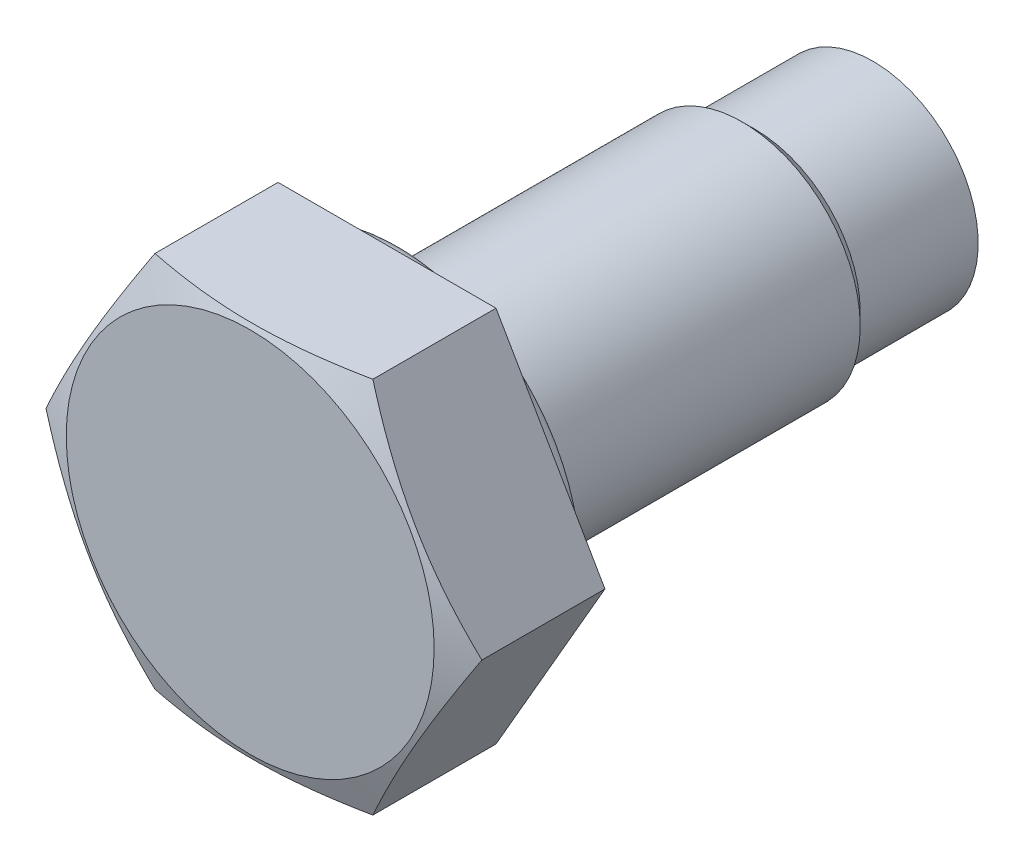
ISO-10303-21;
HEADER;
FILE_DESCRIPTION(('STEP AP214'),'2;1');
FILE_NAME('part.step','',(''),(''),'','','');
FILE_SCHEMA(('AUTOMOTIVE_DESIGN { 1 0 10303 214 1 1 1 1 }'));
ENDSEC;
DATA;
#1=APPLICATION_CONTEXT('core data for automotive mechanical design processes');
#2=APPLICATION_PROTOCOL_DEFINITION('international standard','automotive_design',2000,#1);
#3=PRODUCT_CONTEXT('',#1,'mechanical');
#4=PRODUCT('Part','Part','',(#3));
#5=PRODUCT_RELATED_PRODUCT_CATEGORY('part','',(#4));
#6=PRODUCT_DEFINITION_FORMATION('','',#4);
#7=PRODUCT_DEFINITION_CONTEXT('part definition',#1,'design');
#8=PRODUCT_DEFINITION('design','',#6,#7);
#9=PRODUCT_DEFINITION_SHAPE('','',#8);
#10=(LENGTH_UNIT() NAMED_UNIT(*) SI_UNIT(.MILLI.,.METRE.));
#11=(NAMED_UNIT(*) PLANE_ANGLE_UNIT() SI_UNIT($,.RADIAN.));
#12=(NAMED_UNIT(*) SI_UNIT($,.STERADIAN.) SOLID_ANGLE_UNIT());
#13=UNCERTAINTY_MEASURE_WITH_UNIT(LENGTH_MEASURE(1.E-05),#10,'distance_accuracy_value','');
#14=(GEOMETRIC_REPRESENTATION_CONTEXT(3) GLOBAL_UNCERTAINTY_ASSIGNED_CONTEXT((#13)) GLOBAL_UNIT_ASSIGNED_CONTEXT((#10,
#11,#12)) REPRESENTATION_CONTEXT('',''));
#15=CARTESIAN_POINT('',(0.,0.,0.));
#16=DIRECTION('',(0.,0.,1.));
#17=DIRECTION('',(1.,0.,0.));
#18=AXIS2_PLACEMENT_3D('',#15,#16,#17);
#19=CARTESIAN_POINT('',(0.,7.915,0.6));
#20=DIRECTION('',(0.,0.,1.));
#21=DIRECTION('',(1.,0.,0.));
#22=AXIS2_PLACEMENT_3D('',#19,#20,#21);
#23=PLANE('',#22);
#24=CARTESIAN_POINT('',(0.,0.,0.6));
#25=DIRECTION('',(0.,0.,1.));
#26=DIRECTION('',(1.,0.,0.));
#27=AXIS2_PLACEMENT_3D('',#24,#25,#26);
#28=CIRCLE('',#27,7.915);
#29=CARTESIAN_POINT('',(7.915,0.,0.6));
#30=VERTEX_POINT('',#29);
#31=EDGE_CURVE('E242',#30,#30,#28,.T.);
#32=ORIENTED_EDGE('',*,*,#31,.T.);
#33=EDGE_LOOP('',(#32));
#34=FACE_BOUND('',#33,.T.);
#35=DIRECTION('',(-1.,0.,0.));
#36=VECTOR('',#35,1.);
#37=CARTESIAN_POINT('',(0.,-7.99999626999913,0.6));
#38=LINE('',#37,#36);
#39=CARTESIAN_POINT('',(4.6188,-7.99999626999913,0.6));
#40=VERTEX_POINT('',#39);
#41=CARTESIAN_POINT('',(-4.6188,-7.99999626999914,0.6));
#42=VERTEX_POINT('',#41);
#43=EDGE_CURVE('E228',#40,#42,#38,.T.);
#44=ORIENTED_EDGE('',*,*,#43,.T.);
#45=DIRECTION('',(-0.5,0.866025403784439,0.));
#46=VECTOR('',#45,1.);
#47=CARTESIAN_POINT('',(-10.3554955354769,1.93625186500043,0.6));
#48=LINE('',#47,#46);
#49=CARTESIAN_POINT('',(-9.2376,0.,0.6));
#50=VERTEX_POINT('',#49);
#51=EDGE_CURVE('E98',#42,#50,#48,.T.);
#52=ORIENTED_EDGE('',*,*,#51,.T.);
#53=DIRECTION('',(0.5,0.866025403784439,0.));
#54=VECTOR('',#53,1.);
#55=CARTESIAN_POINT('',(-3.50090446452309,9.93624813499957,0.6));
#56=LINE('',#55,#54);
#57=CARTESIAN_POINT('',(-4.6188,7.99999626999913,0.6));
#58=VERTEX_POINT('',#57);
#59=EDGE_CURVE('E236',#50,#58,#56,.T.);
#60=ORIENTED_EDGE('',*,*,#59,.T.);
#61=DIRECTION('',(1.,0.,0.));
#62=VECTOR('',#61,1.);
#63=CARTESIAN_POINT('',(0.,7.99999626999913,0.6));
#64=LINE('',#63,#62);
#65=CARTESIAN_POINT('',(4.6188,7.99999626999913,0.6));
#66=VERTEX_POINT('',#65);
#67=EDGE_CURVE('E233',#58,#66,#64,.T.);
#68=ORIENTED_EDGE('',*,*,#67,.T.);
#69=DIRECTION('',(0.5,-0.866025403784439,0.));
#70=VECTOR('',#69,1.);
#71=CARTESIAN_POINT('',(3.50090446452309,9.93624813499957,0.6));
#72=LINE('',#71,#70);
#73=CARTESIAN_POINT('',(9.2376,0.,0.6));
#74=VERTEX_POINT('',#73);
#75=EDGE_CURVE('E231',#66,#74,#72,.T.);
#76=ORIENTED_EDGE('',*,*,#75,.T.);
#77=DIRECTION('',(-0.5,-0.866025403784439,0.));
#78=VECTOR('',#77,1.);
#79=CARTESIAN_POINT('',(10.3554955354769,1.93625186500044,0.6));
#80=LINE('',#79,#78);
#81=EDGE_CURVE('E216',#74,#40,#80,.T.);
#82=ORIENTED_EDGE('',*,*,#81,.T.);
#83=EDGE_LOOP('',(#44,#52,#60,#68,#76,#82));
#84=FACE_BOUND('',#83,.T.);
#85=ADVANCED_FACE('F31',(#34,#84),#23,.F.);
#86=CARTESIAN_POINT('',(0.,0.,-15.));
#87=DIRECTION('',(0.,0.,1.));
#88=DIRECTION('',(1.,0.,0.));
#89=AXIS2_PLACEMENT_3D('',#86,#87,#88);
#90=CONICAL_SURFACE('',#89,4.45875,0.78539816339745);
#91=CARTESIAN_POINT('',(0.,0.,-14.45875));
#92=DIRECTION('',(0.,0.,1.));
#93=DIRECTION('',(1.,0.,0.));
#94=AXIS2_PLACEMENT_3D('',#91,#92,#93);
#95=CIRCLE('',#94,5.);
#96=CARTESIAN_POINT('',(5.,0.,-14.45875));
#97=VERTEX_POINT('',#96);
#98=EDGE_CURVE('E91',#97,#97,#95,.T.);
#99=ORIENTED_EDGE('',*,*,#98,.F.);
#100=EDGE_LOOP('',(#99));
#101=FACE_BOUND('',#100,.T.);
#102=CARTESIAN_POINT('',(0.,0.,-15.));
#103=DIRECTION('',(0.,0.,-1.));
#104=DIRECTION('',(-1.,0.,0.));
#105=AXIS2_PLACEMENT_3D('',#102,#103,#104);
#106=CIRCLE('',#105,4.45875);
#107=CARTESIAN_POINT('',(-4.45875,0.,-15.));
#108=VERTEX_POINT('',#107);
#109=EDGE_CURVE('E321',#108,#108,#106,.T.);
#110=ORIENTED_EDGE('',*,*,#109,.F.);
#111=EDGE_LOOP('',(#110));
#112=FACE_BOUND('',#111,.T.);
#113=ADVANCED_FACE('F33',(#101,#112),#90,.T.);
#114=CARTESIAN_POINT('',(0.,0.,6.4));
#115=DIRECTION('',(0.,0.,1.));
#116=DIRECTION('',(1.,0.,0.));
#117=AXIS2_PLACEMENT_3D('',#114,#115,#116);
#118=CYLINDRICAL_SURFACE('',#117,5.);
#119=CARTESIAN_POINT('',(0.,0.,-1.));
#120=DIRECTION('',(0.,0.,1.));
#121=DIRECTION('',(1.,0.,0.));
#122=AXIS2_PLACEMENT_3D('',#119,#120,#121);
#123=CIRCLE('',#122,5.);
#124=CARTESIAN_POINT('',(5.,0.,-1.));
#125=VERTEX_POINT('',#124);
#126=EDGE_CURVE('E184',#125,#125,#123,.T.);
#127=ORIENTED_EDGE('',*,*,#126,.F.);
#128=EDGE_LOOP('',(#127));
#129=FACE_BOUND('',#128,.T.);
#130=ORIENTED_EDGE('',*,*,#98,.T.);
#131=EDGE_LOOP('',(#130));
#132=FACE_BOUND('',#131,.T.);
#133=ADVANCED_FACE('F150',(#129,#132),#118,.T.);
#134=CARTESIAN_POINT('',(0.,5.,-1.));
#135=DIRECTION('',(0.,0.,-1.));
#136=DIRECTION('',(-1.,0.,0.));
#137=AXIS2_PLACEMENT_3D('',#134,#135,#136);
#138=PLANE('',#137);
#139=CARTESIAN_POINT('',(0.,0.,-1.));
#140=DIRECTION('',(0.,0.,1.));
#141=DIRECTION('',(1.,0.,0.));
#142=AXIS2_PLACEMENT_3D('',#139,#140,#141);
#143=CIRCLE('',#142,4.45875);
#144=CARTESIAN_POINT('',(4.45875,0.,-1.));
#145=VERTEX_POINT('',#144);
#146=EDGE_CURVE('E188',#145,#145,#143,.T.);
#147=ORIENTED_EDGE('',*,*,#146,.F.);
#148=EDGE_LOOP('',(#147));
#149=FACE_BOUND('',#148,.T.);
#150=ORIENTED_EDGE('',*,*,#126,.T.);
#151=EDGE_LOOP('',(#150));
#152=FACE_BOUND('',#151,.T.);
#153=ADVANCED_FACE('F173',(#149,#152),#138,.F.);
#154=CARTESIAN_POINT('',(0.,0.,-1.));
#155=DIRECTION('',(0.,0.,1.));
#156=DIRECTION('',(1.,0.,0.));
#157=AXIS2_PLACEMENT_3D('',#154,#155,#156);
#158=CONICAL_SURFACE('',#157,4.45875,1.0471975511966);
#159=CARTESIAN_POINT('',(0.,0.,-0.687509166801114));
#160=DIRECTION('',(0.,0.,1.));
#161=DIRECTION('',(1.,0.,0.));
#162=AXIS2_PLACEMENT_3D('',#159,#160,#161);
#163=CIRCLE('',#162,5.);
#164=CARTESIAN_POINT('',(5.,0.,-0.687509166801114));
#165=VERTEX_POINT('',#164);
#166=EDGE_CURVE('E253',#165,#165,#163,.T.);
#167=ORIENTED_EDGE('',*,*,#166,.F.);
#168=EDGE_LOOP('',(#167));
#169=FACE_BOUND('',#168,.T.);
#170=ORIENTED_EDGE('',*,*,#146,.T.);
#171=EDGE_LOOP('',(#170));
#172=FACE_BOUND('',#171,.T.);
#173=ADVANCED_FACE('F169',(#169,#172),#158,.T.);
#174=CARTESIAN_POINT('',(0.,0.,6.4));
#175=DIRECTION('',(0.,0.,1.));
#176=DIRECTION('',(1.,0.,0.));
#177=AXIS2_PLACEMENT_3D('',#174,#175,#176);
#178=CYLINDRICAL_SURFACE('',#177,5.);
#179=CARTESIAN_POINT('',(0.,0.,-0.5));
#180=DIRECTION('',(0.,0.,1.));
#181=DIRECTION('',(1.,0.,0.));
#182=AXIS2_PLACEMENT_3D('',#179,#180,#181);
#183=CIRCLE('',#182,5.);
#184=CARTESIAN_POINT('',(5.,0.,-0.5));
#185=VERTEX_POINT('',#184);
#186=EDGE_CURVE('E250',#185,#185,#183,.T.);
#187=ORIENTED_EDGE('',*,*,#186,.F.);
#188=EDGE_LOOP('',(#187));
#189=FACE_BOUND('',#188,.T.);
#190=ORIENTED_EDGE('',*,*,#166,.T.);
#191=EDGE_LOOP('',(#190));
#192=FACE_BOUND('',#191,.T.);
#193=ADVANCED_FACE('F165',(#189,#192),#178,.T.);
#194=CARTESIAN_POINT('',(0.,0.,-0.5));
#195=DIRECTION('',(0.,0.,1.));
#196=DIRECTION('',(1.,0.,0.));
#197=AXIS2_PLACEMENT_3D('',#194,#195,#196);
#198=TOROIDAL_SURFACE('',#197,5.5,0.5);
#199=ORIENTED_EDGE('',*,*,#186,.T.);
#200=EDGE_LOOP('',(#199));
#201=FACE_BOUND('',#200,.T.);
#202=CARTESIAN_POINT('',(0.,0.,0.));
#203=DIRECTION('',(0.,0.,1.));
#204=DIRECTION('',(1.,0.,0.));
#205=AXIS2_PLACEMENT_3D('',#202,#203,#204);
#206=CIRCLE('',#205,5.5);
#207=CARTESIAN_POINT('',(5.5,0.,0.));
#208=VERTEX_POINT('',#207);
#209=EDGE_CURVE('E247',#208,#208,#206,.T.);
#210=ORIENTED_EDGE('',*,*,#209,.F.);
#211=EDGE_LOOP('',(#210));
#212=FACE_BOUND('',#211,.T.);
#213=ADVANCED_FACE('F161',(#201,#212),#198,.F.);
#214=CARTESIAN_POINT('',(0.,5.5,0.));
#215=DIRECTION('',(0.,0.,1.));
#216=DIRECTION('',(1.,0.,0.));
#217=AXIS2_PLACEMENT_3D('',#214,#215,#216);
#218=PLANE('',#217);
#219=CARTESIAN_POINT('',(0.,0.,0.));
#220=DIRECTION('',(0.,0.,1.));
#221=DIRECTION('',(1.,0.,0.));
#222=AXIS2_PLACEMENT_3D('',#219,#220,#221);
#223=CIRCLE('',#222,7.315);
#224=CARTESIAN_POINT('',(7.315,0.,0.));
#225=VERTEX_POINT('',#224);
#226=EDGE_CURVE('E244',#225,#225,#223,.T.);
#227=ORIENTED_EDGE('',*,*,#226,.F.);
#228=EDGE_LOOP('',(#227));
#229=FACE_BOUND('',#228,.T.);
#230=ORIENTED_EDGE('',*,*,#209,.T.);
#231=EDGE_LOOP('',(#230));
#232=FACE_BOUND('',#231,.T.);
#233=ADVANCED_FACE('F157',(#229,#232),#218,.F.);
#234=CARTESIAN_POINT('',(0.,0.,0.6));
#235=DIRECTION('',(0.,0.,1.));
#236=DIRECTION('',(1.,0.,0.));
#237=AXIS2_PLACEMENT_3D('',#234,#235,#236);
#238=TOROIDAL_SURFACE('',#237,7.315,0.6);
#239=ORIENTED_EDGE('',*,*,#31,.F.);
#240=EDGE_LOOP('',(#239));
#241=FACE_BOUND('',#240,.T.);
#242=ORIENTED_EDGE('',*,*,#226,.T.);
#243=EDGE_LOOP('',(#242));
#244=FACE_BOUND('',#243,.T.);
#245=ADVANCED_FACE('F132',(#241,#244),#238,.T.);
#246=CARTESIAN_POINT('',(-4.6188,-7.99999626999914,-15.));
#247=DIRECTION('',(0.866025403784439,0.5,0.));
#248=DIRECTION('',(0.5,-0.866025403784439,0.));
#249=AXIS2_PLACEMENT_3D('',#246,#247,#248);
#250=PLANE('',#249);
#251=ORIENTED_EDGE('',*,*,#51,.F.);
#252=DIRECTION('',(0.,0.,1.));
#253=VECTOR('',#252,1.);
#254=CARTESIAN_POINT('',(-4.6188,-7.99999626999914,-15.));
#255=LINE('',#254,#253);
#256=CARTESIAN_POINT('',(-4.6188,-7.99999626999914,5.81818181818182));
#257=VERTEX_POINT('',#256);
#258=EDGE_CURVE('E51',#42,#257,#255,.T.);
#259=ORIENTED_EDGE('',*,*,#258,.T.);
#260=CARTESIAN_POINT('',(-9.23760011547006,2.00000000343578E-07,5.81818177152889));
#261=CARTESIAN_POINT('',(-9.07623171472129,-0.279498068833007,5.88338258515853));
#262=CARTESIAN_POINT('',(-8.91433070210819,-0.559918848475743,5.94367122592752));
#263=CARTESIAN_POINT('',(-8.58945812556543,-1.12261465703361,6.0525711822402));
#264=CARTESIAN_POINT('',(-8.42648599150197,-1.40489067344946,6.10117565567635));
#265=CARTESIAN_POINT('',(-8.09970314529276,-1.97089516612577,6.184761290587));
#266=CARTESIAN_POINT('',(-7.93589269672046,-2.25462318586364,6.21974649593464));
#267=CARTESIAN_POINT('',(-7.60766331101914,-2.82313315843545,6.27447232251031));
#268=CARTESIAN_POINT('',(-7.44324451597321,-3.10791486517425,6.2942163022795));
#269=CARTESIAN_POINT('',(-7.116909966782,-3.67314288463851,6.31723187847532));
#270=CARTESIAN_POINT('',(-6.95499911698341,-3.95358070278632,6.3207774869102));
#271=CARTESIAN_POINT('',(-6.63127309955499,-4.51429061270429,6.31195075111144));
#272=CARTESIAN_POINT('',(-6.46945794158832,-4.79456268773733,6.29957700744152));
#273=CARTESIAN_POINT('',(-6.14641204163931,-5.35409459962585,6.25957675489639));
#274=CARTESIAN_POINT('',(-5.98518099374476,-5.63335496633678,6.23195993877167));
#275=CARTESIAN_POINT('',(-5.66348869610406,-6.19054237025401,6.16281191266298));
#276=CARTESIAN_POINT('',(-5.5030273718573,-6.46846953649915,6.12128207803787));
#277=CARTESIAN_POINT('',(-5.28250881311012,-6.85041888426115,6.05563542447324));
#278=CARTESIAN_POINT('',(-5.22204978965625,-6.95513698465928,6.03674445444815));
#279=CARTESIAN_POINT('',(-5.10127443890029,-7.16432602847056,5.99731748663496));
#280=CARTESIAN_POINT('',(-5.04095809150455,-7.26879700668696,5.9767817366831));
#281=CARTESIAN_POINT('',(-4.92025661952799,-7.4778580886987,5.93408711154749));
#282=CARTESIAN_POINT('',(-4.85987196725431,-7.58244737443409,5.91192291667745));
#283=CARTESIAN_POINT('',(-4.73923496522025,-7.79139679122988,5.86612783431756));
#284=CARTESIAN_POINT('',(-4.67898263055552,-7.89575689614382,5.84249678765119));
#285=CARTESIAN_POINT('',(-4.61879988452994,-7.99999646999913,5.81818177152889));
#286=B_SPLINE_CURVE_WITH_KNOTS('',3,(#260,#261,#262,#263,#264,#265,#266,#267,#268,#269,#270,
#271,#272,#273,#274,#275,#276,#277,#278,#279,#280,#281,#282,#283,#284,#285),.UNSPECIFIED.,.F.,
.F.,(4,2,2,2,2,2,2,2,2,2,2,2,4),(0.,0.987840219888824,1.97625750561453,2.96438108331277,
3.95228685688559,4.92341776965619,5.89463405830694,6.86523348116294,7.83573698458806,
8.20288448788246,8.56997677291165,8.93832669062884,9.30671665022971),.UNSPECIFIED.);
#287=CARTESIAN_POINT('',(-9.2376,0.,5.81818181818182));
#288=VERTEX_POINT('',#287);
#289=EDGE_CURVE('E11',#288,#257,#286,.T.);
#290=ORIENTED_EDGE('',*,*,#289,.F.);
#291=DIRECTION('',(0.,0.,1.));
#292=VECTOR('',#291,1.);
#293=CARTESIAN_POINT('',(-9.2376,0.,-15.));
#294=LINE('',#293,#292);
#295=EDGE_CURVE('E226',#50,#288,#294,.T.);
#296=ORIENTED_EDGE('',*,*,#295,.F.);
#297=EDGE_LOOP('',(#251,#259,#290,#296));
#298=FACE_BOUND('',#297,.T.);
#299=ADVANCED_FACE('F94',(#298),#250,.F.);
#300=CARTESIAN_POINT('',(-9.2376,0.,-15.));
#301=DIRECTION('',(0.866025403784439,-0.5,0.));
#302=DIRECTION('',(-0.5,-0.866025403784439,0.));
#303=AXIS2_PLACEMENT_3D('',#300,#301,#302);
#304=PLANE('',#303);
#305=ORIENTED_EDGE('',*,*,#59,.F.);
#306=ORIENTED_EDGE('',*,*,#295,.T.);
#307=CARTESIAN_POINT('',(-4.61879988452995,7.99999646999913,5.81818177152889));
#308=CARTESIAN_POINT('',(-4.78016828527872,7.72049820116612,5.88338258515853));
#309=CARTESIAN_POINT('',(-4.94206929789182,7.44007742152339,5.94367122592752));
#310=CARTESIAN_POINT('',(-5.26694187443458,6.87738161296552,6.0525711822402));
#311=CARTESIAN_POINT('',(-5.42991400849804,6.59510559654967,6.10117565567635));
#312=CARTESIAN_POINT('',(-5.75669685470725,6.02910110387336,6.184761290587));
#313=CARTESIAN_POINT('',(-5.92050730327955,5.74537308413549,6.21974649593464));
#314=CARTESIAN_POINT('',(-6.24873668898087,5.17686311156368,6.27447232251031));
#315=CARTESIAN_POINT('',(-6.4131554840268,4.89208140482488,6.2942163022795));
#316=CARTESIAN_POINT('',(-6.73949003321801,4.32685338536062,6.31723187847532));
#317=CARTESIAN_POINT('',(-6.90140088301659,4.04641556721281,6.3207774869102));
#318=CARTESIAN_POINT('',(-7.22512690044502,3.48570565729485,6.31195075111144));
#319=CARTESIAN_POINT('',(-7.38694205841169,3.2054335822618,6.29957700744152));
#320=CARTESIAN_POINT('',(-7.7099879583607,2.64590167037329,6.25957675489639));
#321=CARTESIAN_POINT('',(-7.87121900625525,2.36664130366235,6.23195993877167));
#322=CARTESIAN_POINT('',(-8.19291130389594,1.80945389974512,6.16281191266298));
#323=CARTESIAN_POINT('',(-8.35337262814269,1.53152673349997,6.12128207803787));
#324=CARTESIAN_POINT('',(-8.57389118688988,1.14957738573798,6.05563542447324));
#325=CARTESIAN_POINT('',(-8.63435021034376,1.04485928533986,6.03674445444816));
#326=CARTESIAN_POINT('',(-8.75512556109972,0.835670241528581,5.99731748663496));
#327=CARTESIAN_POINT('',(-8.81544190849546,0.731199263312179,5.9767817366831));
#328=CARTESIAN_POINT('',(-8.93614338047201,0.522138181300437,5.93408711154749));
#329=CARTESIAN_POINT('',(-8.99652803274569,0.417548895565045,5.91192291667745));
#330=CARTESIAN_POINT('',(-9.11716503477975,0.20859947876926,5.86612783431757));
#331=CARTESIAN_POINT('',(-9.17741736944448,0.104239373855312,5.84249678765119));
#332=CARTESIAN_POINT('',(-9.23760011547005,-1.99999999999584E-07,5.81818177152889));
#333=B_SPLINE_CURVE_WITH_KNOTS('',3,(#307,#308,#309,#310,#311,#312,#313,#314,#315,#316,#317,
#318,#319,#320,#321,#322,#323,#324,#325,#326,#327,#328,#329,#330,#331,#332),.UNSPECIFIED.,.F.,
.F.,(4,2,2,2,2,2,2,2,2,2,2,2,4),(0.,0.987840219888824,1.97625750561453,2.96438108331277,
3.95228685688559,4.92341776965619,5.89463405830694,6.86523348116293,7.83573698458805,
8.20288448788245,8.56997677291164,8.93832669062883,9.3067166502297),.UNSPECIFIED.);
#334=CARTESIAN_POINT('',(-4.6188,7.99999626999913,5.81818181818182));
#335=VERTEX_POINT('',#334);
#336=EDGE_CURVE('E44',#335,#288,#333,.T.);
#337=ORIENTED_EDGE('',*,*,#336,.F.);
#338=DIRECTION('',(0.,0.,1.));
#339=VECTOR('',#338,1.);
#340=CARTESIAN_POINT('',(-4.6188,7.99999626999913,-15.));
#341=LINE('',#340,#339);
#342=EDGE_CURVE('E221',#58,#335,#341,.T.);
#343=ORIENTED_EDGE('',*,*,#342,.F.);
#344=EDGE_LOOP('',(#305,#306,#337,#343));
#345=FACE_BOUND('',#344,.T.);
#346=ADVANCED_FACE('F124',(#345),#304,.F.);
#347=CARTESIAN_POINT('',(-4.6188,7.99999626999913,-15.));
#348=DIRECTION('',(0.,-1.,0.));
#349=DIRECTION('',(-1.,0.,0.));
#350=AXIS2_PLACEMENT_3D('',#347,#348,#349);
#351=PLANE('',#350);
#352=ORIENTED_EDGE('',*,*,#67,.F.);
#353=ORIENTED_EDGE('',*,*,#342,.T.);
#354=CARTESIAN_POINT('',(-12.5719547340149,7.99999626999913,3.52982738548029));
#355=CARTESIAN_POINT('',(-12.1983187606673,7.99999626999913,3.65714990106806));
#356=CARTESIAN_POINT('',(-11.8241969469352,7.99999626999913,3.78307295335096));
#357=CARTESIAN_POINT('',(-11.0747197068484,7.99999626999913,4.03131289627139));
#358=CARTESIAN_POINT('',(-10.6993641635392,7.99999626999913,4.15362943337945));
#359=CARTESIAN_POINT('',(-9.94620503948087,7.99999626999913,4.39415137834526));
#360=CARTESIAN_POINT('',(-9.56839757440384,7.99999626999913,4.51234466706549));
#361=CARTESIAN_POINT('',(-8.81107863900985,7.99999626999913,4.74312776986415));
#362=CARTESIAN_POINT('',(-8.43156721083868,7.99999626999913,4.8557177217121));
#363=CARTESIAN_POINT('',(-7.67246142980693,7.99999626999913,5.07327543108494));
#364=CARTESIAN_POINT('',(-7.29287748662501,7.99999626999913,5.17827932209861));
#365=CARTESIAN_POINT('',(-6.53133965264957,7.99999626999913,5.37943691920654));
#366=CARTESIAN_POINT('',(-6.14938567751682,7.99999626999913,5.47559030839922));
#367=CARTESIAN_POINT('',(-5.38308686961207,7.99999626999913,5.65661961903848));
#368=CARTESIAN_POINT('',(-4.99874399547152,7.99999626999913,5.74150375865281));
#369=CARTESIAN_POINT('',(-4.22720948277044,7.99999626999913,5.89721151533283));
#370=CARTESIAN_POINT('',(-3.84001810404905,7.99999626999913,5.96803639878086));
#371=CARTESIAN_POINT('',(-3.15468340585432,7.99999626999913,6.07772100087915));
#372=CARTESIAN_POINT('',(-2.85711851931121,7.99999626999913,6.12017938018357));
#373=CARTESIAN_POINT('',(-2.26056309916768,7.99999626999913,6.19360511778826));
#374=CARTESIAN_POINT('',(-1.9615726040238,7.99999626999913,6.22457278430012));
#375=CARTESIAN_POINT('',(-1.36269467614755,7.99999626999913,6.27378877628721));
#376=CARTESIAN_POINT('',(-1.06280781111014,7.99999626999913,6.29204392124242));
#377=CARTESIAN_POINT('',(-0.462511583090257,7.99999626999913,6.31505964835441));
#378=CARTESIAN_POINT('',(-0.162102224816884,7.99999626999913,6.31982035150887));
#379=CARTESIAN_POINT('',(0.438718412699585,7.99999626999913,6.31562600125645));
#380=CARTESIAN_POINT('',(0.739129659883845,7.99999626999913,6.30666642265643));
#381=CARTESIAN_POINT('',(1.33925291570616,7.99999626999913,6.27543464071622));
#382=CARTESIAN_POINT('',(1.63896491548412,7.99999626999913,6.25316226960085));
#383=CARTESIAN_POINT('',(2.23737206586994,7.99999626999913,6.19623962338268));
#384=CARTESIAN_POINT('',(2.53606652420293,7.99999626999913,6.16158216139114));
#385=CARTESIAN_POINT('',(3.13194924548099,7.99999626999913,6.08119272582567));
#386=CARTESIAN_POINT('',(3.42913747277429,7.99999626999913,6.03546049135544));
#387=CARTESIAN_POINT('',(4.11363187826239,7.99999626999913,5.91871471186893));
#388=CARTESIAN_POINT('',(4.50034816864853,7.99999626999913,5.84425774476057));
#389=CARTESIAN_POINT('',(5.27095740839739,7.99999626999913,5.68198807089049));
#390=CARTESIAN_POINT('',(5.65485012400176,7.99999626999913,5.59417427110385));
#391=CARTESIAN_POINT('',(6.42025470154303,7.99999626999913,5.40788960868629));
#392=CARTESIAN_POINT('',(6.80176506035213,7.99999626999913,5.30941262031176));
#393=CARTESIAN_POINT('',(7.56249587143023,7.99999626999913,5.10408437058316));
#394=CARTESIAN_POINT('',(7.94171640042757,7.99999626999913,4.99723339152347));
#395=CARTESIAN_POINT('',(8.69926332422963,7.99999626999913,4.77660865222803));
#396=CARTESIAN_POINT('',(9.07758437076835,7.99999626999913,4.66281661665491));
#397=CARTESIAN_POINT('',(9.83259783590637,7.99999626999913,4.42994140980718));
#398=CARTESIAN_POINT('',(10.2092902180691,7.99999626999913,4.31085812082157));
#399=CARTESIAN_POINT('',(10.9604179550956,7.99999626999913,4.06875367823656));
#400=CARTESIAN_POINT('',(11.3348565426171,7.99999626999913,3.94574252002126));
#401=CARTESIAN_POINT('',(12.0825558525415,7.99999626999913,3.69629462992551));
#402=CARTESIAN_POINT('',(12.4558166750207,7.99999626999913,3.56985819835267));
#403=CARTESIAN_POINT('',(12.8286123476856,7.99999626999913,3.44208796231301));
#404=B_SPLINE_CURVE_WITH_KNOTS('',3,(#354,#355,#356,#357,#358,#359,#360,#361,#362,#363,#364,
#365,#366,#367,#368,#369,#370,#371,#372,#373,#374,#375,#376,#377,#378,#379,#380,#381,#382,#383,
#384,#385,#386,#387,#388,#389,#390,#391,#392,#393,#394,#395,#396,#397,#398,#399,#400,#401,#402,
#403),.UNSPECIFIED.,.F.,.F.,(4,2,2,2,2,2,2,2,2,2,2,2,2,2,2,2,2,2,2,2,2,2,2,2,4),(0.,
1.18421166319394,2.36853902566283,3.55609567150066,4.74362310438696,5.92505950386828,
7.10653818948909,8.28715048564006,9.46765639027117,10.3692009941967,11.2707214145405,
12.1717578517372,13.0727862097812,13.9741118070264,14.8754487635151,15.777309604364,
16.6791916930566,17.8603375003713,19.0415800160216,20.2235047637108,21.4053896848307,
22.5905333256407,23.7757033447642,24.9580661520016,26.1403256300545),.UNSPECIFIED.);
#405=CARTESIAN_POINT('',(4.6188,7.99999626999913,5.81818181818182));
#406=VERTEX_POINT('',#405);
#407=EDGE_CURVE('E106',#406,#335,#404,.F.);
#408=ORIENTED_EDGE('',*,*,#407,.F.);
#409=DIRECTION('',(0.,0.,1.));
#410=VECTOR('',#409,1.);
#411=CARTESIAN_POINT('',(4.6188,7.99999626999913,-15.));
#412=LINE('',#411,#410);
#413=EDGE_CURVE('E218',#66,#406,#412,.T.);
#414=ORIENTED_EDGE('',*,*,#413,.F.);
#415=EDGE_LOOP('',(#352,#353,#408,#414));
#416=FACE_BOUND('',#415,.T.);
#417=ADVANCED_FACE('F127',(#416),#351,.F.);
#418=CARTESIAN_POINT('',(4.6188,7.99999626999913,-15.));
#419=DIRECTION('',(-0.866025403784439,-0.5,0.));
#420=DIRECTION('',(-0.5,0.866025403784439,0.));
#421=AXIS2_PLACEMENT_3D('',#418,#419,#420);
#422=PLANE('',#421);
#423=ORIENTED_EDGE('',*,*,#75,.F.);
#424=ORIENTED_EDGE('',*,*,#413,.T.);
#425=CARTESIAN_POINT('',(9.23760011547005,-1.9999999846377E-07,5.81818177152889));
#426=CARTESIAN_POINT('',(9.07623171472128,0.279498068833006,5.88338258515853));
#427=CARTESIAN_POINT('',(8.91433070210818,0.559918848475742,5.94367122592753));
#428=CARTESIAN_POINT('',(8.58945812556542,1.12261465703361,6.0525711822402));
#429=CARTESIAN_POINT('',(8.42648599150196,1.40489067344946,6.10117565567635));
#430=CARTESIAN_POINT('',(8.09970314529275,1.97089516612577,6.18476129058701));
#431=CARTESIAN_POINT('',(7.93589269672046,2.25462318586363,6.21974649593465));
#432=CARTESIAN_POINT('',(7.60766331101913,2.82313315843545,6.27447232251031));
#433=CARTESIAN_POINT('',(7.44324451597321,3.10791486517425,6.29421630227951));
#434=CARTESIAN_POINT('',(7.11690996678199,3.67314288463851,6.31723187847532));
#435=CARTESIAN_POINT('',(6.95499911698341,3.95358070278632,6.3207774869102));
#436=CARTESIAN_POINT('',(6.63127309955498,4.51429061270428,6.31195075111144));
#437=CARTESIAN_POINT('',(6.46945794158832,4.79456268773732,6.29957700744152));
#438=CARTESIAN_POINT('',(6.1464120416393,5.35409459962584,6.25957675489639));
#439=CARTESIAN_POINT('',(5.98518099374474,5.63335496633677,6.23195993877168));
#440=CARTESIAN_POINT('',(5.66348869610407,6.19054237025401,6.16281191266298));
#441=CARTESIAN_POINT('',(5.50302737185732,6.46846953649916,6.12128207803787));
#442=CARTESIAN_POINT('',(5.28250881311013,6.85041888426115,6.05563542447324));
#443=CARTESIAN_POINT('',(5.22204978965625,6.95513698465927,6.03674445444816));
#444=CARTESIAN_POINT('',(5.10127443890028,7.16432602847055,5.99731748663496));
#445=CARTESIAN_POINT('',(5.04095809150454,7.26879700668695,5.97678173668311));
#446=CARTESIAN_POINT('',(4.92025661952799,7.47785808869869,5.93408711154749));
#447=CARTESIAN_POINT('',(4.85987196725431,7.58244737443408,5.91192291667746));
#448=CARTESIAN_POINT('',(4.73923496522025,7.79139679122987,5.86612783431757));
#449=CARTESIAN_POINT('',(4.67898263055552,7.89575689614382,5.8424967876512));
#450=CARTESIAN_POINT('',(4.61879988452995,7.99999646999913,5.81818177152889));
#451=B_SPLINE_CURVE_WITH_KNOTS('',3,(#425,#426,#427,#428,#429,#430,#431,#432,#433,#434,#435,
#436,#437,#438,#439,#440,#441,#442,#443,#444,#445,#446,#447,#448,#449,#450),.UNSPECIFIED.,.F.,
.F.,(4,2,2,2,2,2,2,2,2,2,2,2,4),(0.,0.987840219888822,1.97625750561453,2.96438108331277,
3.95228685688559,4.92341776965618,5.89463405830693,6.86523348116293,7.83573698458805,
8.20288448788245,8.56997677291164,8.93832669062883,9.3067166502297),.UNSPECIFIED.);
#452=CARTESIAN_POINT('',(9.2376,0.,5.81818181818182));
#453=VERTEX_POINT('',#452);
#454=EDGE_CURVE('E110',#453,#406,#451,.T.);
#455=ORIENTED_EDGE('',*,*,#454,.F.);
#456=DIRECTION('',(0.,0.,1.));
#457=VECTOR('',#456,1.);
#458=CARTESIAN_POINT('',(9.2376,0.,-15.));
#459=LINE('',#458,#457);
#460=EDGE_CURVE('E215',#74,#453,#459,.T.);
#461=ORIENTED_EDGE('',*,*,#460,.F.);
#462=EDGE_LOOP('',(#423,#424,#455,#461));
#463=FACE_BOUND('',#462,.T.);
#464=ADVANCED_FACE('F204',(#463),#422,.F.);
#465=CARTESIAN_POINT('',(9.2376,0.,-15.));
#466=DIRECTION('',(-0.866025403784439,0.5,0.));
#467=DIRECTION('',(0.5,0.866025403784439,0.));
#468=AXIS2_PLACEMENT_3D('',#465,#466,#467);
#469=PLANE('',#468);
#470=ORIENTED_EDGE('',*,*,#81,.F.);
#471=ORIENTED_EDGE('',*,*,#460,.T.);
#472=CARTESIAN_POINT('',(4.61879988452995,-7.99999646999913,5.81818177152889));
#473=CARTESIAN_POINT('',(4.78016828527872,-7.72049820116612,5.88338258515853));
#474=CARTESIAN_POINT('',(4.94206929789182,-7.44007742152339,5.94367122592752));
#475=CARTESIAN_POINT('',(5.26694187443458,-6.87738161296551,6.0525711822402));
#476=CARTESIAN_POINT('',(5.42991400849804,-6.59510559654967,6.10117565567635));
#477=CARTESIAN_POINT('',(5.75669685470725,-6.02910110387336,6.18476129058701));
#478=CARTESIAN_POINT('',(5.92050730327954,-5.74537308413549,6.21974649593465));
#479=CARTESIAN_POINT('',(6.24873668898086,-5.17686311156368,6.27447232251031));
#480=CARTESIAN_POINT('',(6.41315548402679,-4.89208140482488,6.29421630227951));
#481=CARTESIAN_POINT('',(6.739490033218,-4.32685338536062,6.31723187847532));
#482=CARTESIAN_POINT('',(6.90140088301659,-4.04641556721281,6.3207774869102));
#483=CARTESIAN_POINT('',(7.22512690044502,-3.48570565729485,6.31195075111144));
#484=CARTESIAN_POINT('',(7.38694205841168,-3.2054335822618,6.29957700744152));
#485=CARTESIAN_POINT('',(7.7099879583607,-2.64590167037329,6.25957675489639));
#486=CARTESIAN_POINT('',(7.87121900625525,-2.36664130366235,6.23195993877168));
#487=CARTESIAN_POINT('',(8.19291130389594,-1.80945389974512,6.16281191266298));
#488=CARTESIAN_POINT('',(8.3533726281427,-1.53152673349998,6.12128207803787));
#489=CARTESIAN_POINT('',(8.57389118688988,-1.14957738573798,6.05563542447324));
#490=CARTESIAN_POINT('',(8.63435021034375,-1.04485928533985,6.03674445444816));
#491=CARTESIAN_POINT('',(8.75512556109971,-0.835670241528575,5.99731748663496));
#492=CARTESIAN_POINT('',(8.81544190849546,-0.731199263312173,5.97678173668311));
#493=CARTESIAN_POINT('',(8.93614338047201,-0.522138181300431,5.93408711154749));
#494=CARTESIAN_POINT('',(8.99652803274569,-0.417548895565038,5.91192291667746));
#495=CARTESIAN_POINT('',(9.11716503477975,-0.208599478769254,5.86612783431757));
#496=CARTESIAN_POINT('',(9.17741736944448,-0.104239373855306,5.8424967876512));
#497=CARTESIAN_POINT('',(9.23760011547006,2.00000002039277E-07,5.81818177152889));
#498=B_SPLINE_CURVE_WITH_KNOTS('',3,(#472,#473,#474,#475,#476,#477,#478,#479,#480,#481,#482,
#483,#484,#485,#486,#487,#488,#489,#490,#491,#492,#493,#494,#495,#496,#497),.UNSPECIFIED.,.F.,
.F.,(4,2,2,2,2,2,2,2,2,2,2,2,4),(0.,0.987840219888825,1.97625750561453,2.96438108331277,
3.95228685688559,4.92341776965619,5.89463405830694,6.86523348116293,7.83573698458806,
8.20288448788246,8.56997677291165,8.93832669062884,9.30671665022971),.UNSPECIFIED.);
#499=CARTESIAN_POINT('',(4.6188,-7.99999626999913,5.81818181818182));
#500=VERTEX_POINT('',#499);
#501=EDGE_CURVE('E90',#500,#453,#498,.T.);
#502=ORIENTED_EDGE('',*,*,#501,.F.);
#503=DIRECTION('',(0.,0.,1.));
#504=VECTOR('',#503,1.);
#505=CARTESIAN_POINT('',(4.6188,-7.99999626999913,-15.));
#506=LINE('',#505,#504);
#507=EDGE_CURVE('E56',#40,#500,#506,.T.);
#508=ORIENTED_EDGE('',*,*,#507,.F.);
#509=EDGE_LOOP('',(#470,#471,#502,#508));
#510=FACE_BOUND('',#509,.T.);
#511=ADVANCED_FACE('F142',(#510),#469,.F.);
#512=CARTESIAN_POINT('',(4.6188,-7.99999626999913,-15.));
#513=DIRECTION('',(0.,1.,0.));
#514=DIRECTION('',(1.,0.,0.));
#515=AXIS2_PLACEMENT_3D('',#512,#513,#514);
#516=PLANE('',#515);
#517=ORIENTED_EDGE('',*,*,#43,.F.);
#518=ORIENTED_EDGE('',*,*,#507,.T.);
#519=CARTESIAN_POINT('',(-12.5719547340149,-7.99999626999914,3.52982738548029));
#520=CARTESIAN_POINT('',(-12.1983187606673,-7.99999626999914,3.65714990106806));
#521=CARTESIAN_POINT('',(-11.8241969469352,-7.99999626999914,3.78307295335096));
#522=CARTESIAN_POINT('',(-11.0747197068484,-7.99999626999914,4.03131289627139));
#523=CARTESIAN_POINT('',(-10.6993641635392,-7.99999626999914,4.15362943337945));
#524=CARTESIAN_POINT('',(-9.94620503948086,-7.99999626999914,4.39415137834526));
#525=CARTESIAN_POINT('',(-9.56839757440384,-7.99999626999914,4.51234466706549));
#526=CARTESIAN_POINT('',(-8.81107863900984,-7.99999626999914,4.74312776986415));
#527=CARTESIAN_POINT('',(-8.43156721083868,-7.99999626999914,4.8557177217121));
#528=CARTESIAN_POINT('',(-7.67246142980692,-7.99999626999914,5.07327543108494));
#529=CARTESIAN_POINT('',(-7.292877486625,-7.99999626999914,5.17827932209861));
#530=CARTESIAN_POINT('',(-6.53133965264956,-7.99999626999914,5.37943691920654));
#531=CARTESIAN_POINT('',(-6.14938567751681,-7.99999626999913,5.47559030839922));
#532=CARTESIAN_POINT('',(-5.38308686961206,-7.99999626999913,5.65661961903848));
#533=CARTESIAN_POINT('',(-4.99874399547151,-7.99999626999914,5.74150375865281));
#534=CARTESIAN_POINT('',(-4.22720948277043,-7.99999626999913,5.89721151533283));
#535=CARTESIAN_POINT('',(-3.84001810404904,-7.99999626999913,5.96803639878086));
#536=CARTESIAN_POINT('',(-3.15468340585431,-7.99999626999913,6.07772100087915));
#537=CARTESIAN_POINT('',(-2.8571185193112,-7.99999626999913,6.12017938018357));
#538=CARTESIAN_POINT('',(-2.26056309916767,-7.99999626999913,6.19360511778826));
#539=CARTESIAN_POINT('',(-1.96157260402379,-7.99999626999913,6.22457278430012));
#540=CARTESIAN_POINT('',(-1.36269467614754,-7.99999626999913,6.27378877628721));
#541=CARTESIAN_POINT('',(-1.06280781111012,-7.99999626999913,6.29204392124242));
#542=CARTESIAN_POINT('',(-0.462511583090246,-7.99999626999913,6.31505964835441));
#543=CARTESIAN_POINT('',(-0.162102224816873,-7.99999626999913,6.31982035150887));
#544=CARTESIAN_POINT('',(0.438718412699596,-7.99999626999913,6.31562600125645));
#545=CARTESIAN_POINT('',(0.739129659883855,-7.99999626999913,6.30666642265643));
#546=CARTESIAN_POINT('',(1.33925291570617,-7.99999626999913,6.27543464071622));
#547=CARTESIAN_POINT('',(1.63896491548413,-7.99999626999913,6.25316226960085));
#548=CARTESIAN_POINT('',(2.23737206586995,-7.99999626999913,6.19623962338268));
#549=CARTESIAN_POINT('',(2.53606652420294,-7.99999626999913,6.16158216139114));
#550=CARTESIAN_POINT('',(3.131949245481,-7.99999626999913,6.08119272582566));
#551=CARTESIAN_POINT('',(3.4291374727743,-7.99999626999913,6.03546049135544));
#552=CARTESIAN_POINT('',(4.1136318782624,-7.99999626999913,5.91871471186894));
#553=CARTESIAN_POINT('',(4.50034816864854,-7.99999626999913,5.84425774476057));
#554=CARTESIAN_POINT('',(5.2709574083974,-7.99999626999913,5.68198807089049));
#555=CARTESIAN_POINT('',(5.65485012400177,-7.99999626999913,5.59417427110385));
#556=CARTESIAN_POINT('',(6.42025470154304,-7.99999626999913,5.40788960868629));
#557=CARTESIAN_POINT('',(6.80176506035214,-7.99999626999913,5.30941262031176));
#558=CARTESIAN_POINT('',(7.56249587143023,-7.99999626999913,5.10408437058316));
#559=CARTESIAN_POINT('',(7.94171640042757,-7.99999626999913,4.99723339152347));
#560=CARTESIAN_POINT('',(8.69926332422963,-7.99999626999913,4.77660865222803));
#561=CARTESIAN_POINT('',(9.07758437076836,-7.99999626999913,4.66281661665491));
#562=CARTESIAN_POINT('',(9.83259783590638,-7.99999626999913,4.42994140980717));
#563=CARTESIAN_POINT('',(10.2092902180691,-7.99999626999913,4.31085812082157));
#564=CARTESIAN_POINT('',(10.9604179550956,-7.99999626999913,4.06875367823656));
#565=CARTESIAN_POINT('',(11.3348565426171,-7.99999626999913,3.94574252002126));
#566=CARTESIAN_POINT('',(12.0825558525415,-7.99999626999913,3.69629462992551));
#567=CARTESIAN_POINT('',(12.4558166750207,-7.99999626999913,3.56985819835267));
#568=CARTESIAN_POINT('',(12.8286123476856,-7.99999626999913,3.44208796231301));
#569=B_SPLINE_CURVE_WITH_KNOTS('',3,(#519,#520,#521,#522,#523,#524,#525,#526,#527,#528,#529,
#530,#531,#532,#533,#534,#535,#536,#537,#538,#539,#540,#541,#542,#543,#544,#545,#546,#547,#548,
#549,#550,#551,#552,#553,#554,#555,#556,#557,#558,#559,#560,#561,#562,#563,#564,#565,#566,#567,
#568),.UNSPECIFIED.,.F.,.F.,(4,2,2,2,2,2,2,2,2,2,2,2,2,2,2,2,2,2,2,2,2,2,2,2,4),(0.,
1.18421166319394,2.36853902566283,3.55609567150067,4.74362310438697,5.92505950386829,
7.1065381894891,8.28715048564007,9.46765639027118,10.3692009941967,11.2707214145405,
12.1717578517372,13.0727862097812,13.9741118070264,14.8754487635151,15.777309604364,
16.6791916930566,17.8603375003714,19.0415800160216,20.2235047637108,21.4053896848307,
22.5905333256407,23.7757033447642,24.9580661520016,26.1403256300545),.UNSPECIFIED.);
#570=EDGE_CURVE('E86',#257,#500,#569,.T.);
#571=ORIENTED_EDGE('',*,*,#570,.F.);
#572=ORIENTED_EDGE('',*,*,#258,.F.);
#573=EDGE_LOOP('',(#517,#518,#571,#572));
#574=FACE_BOUND('',#573,.T.);
#575=ADVANCED_FACE('F87',(#574),#516,.F.);
#576=CARTESIAN_POINT('',(0.,7.79754946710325,6.4));
#577=DIRECTION('',(0.,0.,-1.));
#578=DIRECTION('',(-1.,0.,0.));
#579=AXIS2_PLACEMENT_3D('',#576,#577,#578);
#580=PLANE('',#579);
#581=CARTESIAN_POINT('',(0.,0.,6.4));
#582=DIRECTION('',(0.,0.,1.));
#583=DIRECTION('',(1.,0.,0.));
#584=AXIS2_PLACEMENT_3D('',#581,#582,#583);
#585=CIRCLE('',#584,7.79754946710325);
#586=CARTESIAN_POINT('',(7.79754946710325,0.,6.4));
#587=VERTEX_POINT('',#586);
#588=EDGE_CURVE('E240',#587,#587,#585,.T.);
#589=ORIENTED_EDGE('',*,*,#588,.T.);
#590=EDGE_LOOP('',(#589));
#591=FACE_BOUND('',#590,.T.);
#592=ADVANCED_FACE('F133',(#591),#580,.F.);
#593=CARTESIAN_POINT('',(0.,0.,5.81818181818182));
#594=DIRECTION('',(0.,0.,-1.));
#595=DIRECTION('',(-1.,0.,0.));
#596=AXIS2_PLACEMENT_3D('',#593,#594,#595);
#597=CONICAL_SURFACE('',#596,9.2376,1.18682389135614);
#598=ORIENTED_EDGE('',*,*,#588,.F.);
#599=EDGE_LOOP('',(#598));
#600=FACE_BOUND('',#599,.T.);
#601=ORIENTED_EDGE('',*,*,#336,.T.);
#602=ORIENTED_EDGE('',*,*,#289,.T.);
#603=ORIENTED_EDGE('',*,*,#570,.T.);
#604=ORIENTED_EDGE('',*,*,#501,.T.);
#605=ORIENTED_EDGE('',*,*,#454,.T.);
#606=ORIENTED_EDGE('',*,*,#407,.T.);
#607=EDGE_LOOP('',(#601,#602,#603,#604,#605,#606));
#608=FACE_BOUND('',#607,.T.);
#609=ADVANCED_FACE('F103',(#600,#608),#597,.T.);
#610=CARTESIAN_POINT('',(0.,0.,-20.));
#611=DIRECTION('',(0.,0.,1.));
#612=DIRECTION('',(1.,0.,0.));
#613=AXIS2_PLACEMENT_3D('',#610,#611,#612);
#614=CYLINDRICAL_SURFACE('',#613,4.45875);
#615=CARTESIAN_POINT('',(0.,0.,-20.));
#616=DIRECTION('',(0.,0.,-1.));
#617=DIRECTION('',(-1.,0.,0.));
#618=AXIS2_PLACEMENT_3D('',#615,#616,#617);
#619=CIRCLE('',#618,4.45875);
#620=CARTESIAN_POINT('',(-4.45875,0.,-20.));
#621=VERTEX_POINT('',#620);
#622=EDGE_CURVE('E100',#621,#621,#619,.T.);
#623=ORIENTED_EDGE('',*,*,#622,.F.);
#624=EDGE_LOOP('',(#623));
#625=FACE_BOUND('',#624,.T.);
#626=ORIENTED_EDGE('',*,*,#109,.T.);
#627=EDGE_LOOP('',(#626));
#628=FACE_BOUND('',#627,.T.);
#629=ADVANCED_FACE('F140',(#625,#628),#614,.T.);
#630=CARTESIAN_POINT('',(0.,0.,-20.));
#631=DIRECTION('',(0.,0.,-1.));
#632=DIRECTION('',(-1.,0.,0.));
#633=AXIS2_PLACEMENT_3D('',#630,#631,#632);
#634=PLANE('',#633);
#635=ORIENTED_EDGE('',*,*,#622,.T.);
#636=EDGE_LOOP('',(#635));
#637=FACE_BOUND('',#636,.T.);
#638=ADVANCED_FACE('F307',(#637),#634,.T.);
#639=CLOSED_SHELL('',(#85,#113,#133,#153,#173,#193,#213,#233,#245,#299,#346,#417,#464,#511,#575,
#592,#609,#629,#638));
#640=MANIFOLD_SOLID_BREP('B2',#639);
#641=ADVANCED_BREP_SHAPE_REPRESENTATION('',(#18,#640),#14);
#642=SHAPE_DEFINITION_REPRESENTATION(#9,#641);
ENDSEC;
END-ISO-10303-21;
